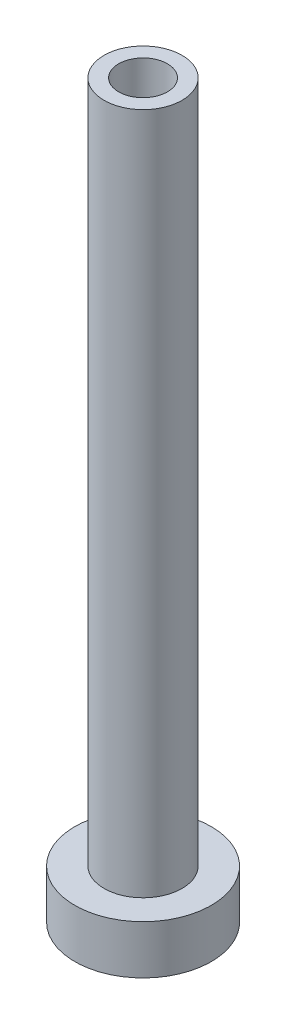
ISO-10303-21;
HEADER;
FILE_DESCRIPTION(('STEP AP214'),'2;1');
FILE_NAME('part.step','',(''),(''),'','','');
FILE_SCHEMA(('AUTOMOTIVE_DESIGN { 1 0 10303 214 1 1 1 1 }'));
ENDSEC;
DATA;
#1=APPLICATION_CONTEXT('core data for automotive mechanical design processes');
#2=APPLICATION_PROTOCOL_DEFINITION('international standard','automotive_design',2000,#1);
#3=PRODUCT_CONTEXT('',#1,'mechanical');
#4=PRODUCT('Part','Part','',(#3));
#5=PRODUCT_RELATED_PRODUCT_CATEGORY('part','',(#4));
#6=PRODUCT_DEFINITION_FORMATION('','',#4);
#7=PRODUCT_DEFINITION_CONTEXT('part definition',#1,'design');
#8=PRODUCT_DEFINITION('design','',#6,#7);
#9=PRODUCT_DEFINITION_SHAPE('','',#8);
#10=(LENGTH_UNIT() NAMED_UNIT(*) SI_UNIT(.MILLI.,.METRE.));
#11=(NAMED_UNIT(*) PLANE_ANGLE_UNIT() SI_UNIT($,.RADIAN.));
#12=(NAMED_UNIT(*) SI_UNIT($,.STERADIAN.) SOLID_ANGLE_UNIT());
#13=UNCERTAINTY_MEASURE_WITH_UNIT(LENGTH_MEASURE(1.E-05),#10,'distance_accuracy_value','');
#14=(GEOMETRIC_REPRESENTATION_CONTEXT(3) GLOBAL_UNCERTAINTY_ASSIGNED_CONTEXT((#13)) GLOBAL_UNIT_ASSIGNED_CONTEXT((#10,
#11,#12)) REPRESENTATION_CONTEXT('',''));
#15=CARTESIAN_POINT('',(0.,0.,0.));
#16=DIRECTION('',(0.,0.,1.));
#17=DIRECTION('',(1.,0.,0.));
#18=AXIS2_PLACEMENT_3D('',#15,#16,#17);
#19=CARTESIAN_POINT('',(0.,0.,0.));
#20=DIRECTION('',(0.,-1.,0.));
#21=DIRECTION('',(0.,0.,-1.));
#22=AXIS2_PLACEMENT_3D('',#19,#20,#21);
#23=CYLINDRICAL_SURFACE('',#22,7.);
#24=CARTESIAN_POINT('',(0.,-5.,0.));
#25=DIRECTION('',(0.,-1.,0.));
#26=DIRECTION('',(0.,0.,-1.));
#27=AXIS2_PLACEMENT_3D('',#24,#25,#26);
#28=CIRCLE('',#27,7.);
#29=CARTESIAN_POINT('',(0.,-5.,-7.));
#30=VERTEX_POINT('',#29);
#31=EDGE_CURVE('E42',#30,#30,#28,.T.);
#32=ORIENTED_EDGE('',*,*,#31,.F.);
#33=EDGE_LOOP('',(#32));
#34=FACE_BOUND('',#33,.T.);
#35=CARTESIAN_POINT('',(0.,0.,0.));
#36=DIRECTION('',(0.,-1.,0.));
#37=DIRECTION('',(0.,0.,-1.));
#38=AXIS2_PLACEMENT_3D('',#35,#36,#37);
#39=CIRCLE('',#38,7.);
#40=CARTESIAN_POINT('',(0.,0.,-7.));
#41=VERTEX_POINT('',#40);
#42=EDGE_CURVE('E9',#41,#41,#39,.T.);
#43=ORIENTED_EDGE('',*,*,#42,.T.);
#44=EDGE_LOOP('',(#43));
#45=FACE_BOUND('',#44,.T.);
#46=ADVANCED_FACE('F14',(#34,#45),#23,.T.);
#47=CARTESIAN_POINT('',(-7.,0.,0.));
#48=DIRECTION('',(0.,-1.,0.));
#49=DIRECTION('',(0.,0.,-1.));
#50=AXIS2_PLACEMENT_3D('',#47,#48,#49);
#51=PLANE('',#50);
#52=ORIENTED_EDGE('',*,*,#42,.F.);
#53=EDGE_LOOP('',(#52));
#54=FACE_BOUND('',#53,.T.);
#55=CARTESIAN_POINT('',(0.,0.,0.));
#56=DIRECTION('',(0.,-1.,0.));
#57=DIRECTION('',(0.,0.,-1.));
#58=AXIS2_PLACEMENT_3D('',#55,#56,#57);
#59=CIRCLE('',#58,4.);
#60=CARTESIAN_POINT('',(0.,0.,-4.));
#61=VERTEX_POINT('',#60);
#62=EDGE_CURVE('E20',#61,#61,#59,.T.);
#63=ORIENTED_EDGE('',*,*,#62,.T.);
#64=EDGE_LOOP('',(#63));
#65=FACE_BOUND('',#64,.T.);
#66=ADVANCED_FACE('F49',(#54,#65),#51,.F.);
#67=CARTESIAN_POINT('',(0.,0.,0.));
#68=DIRECTION('',(0.,-1.,0.));
#69=DIRECTION('',(0.,0.,-1.));
#70=AXIS2_PLACEMENT_3D('',#67,#68,#69);
#71=CYLINDRICAL_SURFACE('',#70,4.);
#72=ORIENTED_EDGE('',*,*,#62,.F.);
#73=EDGE_LOOP('',(#72));
#74=FACE_BOUND('',#73,.T.);
#75=CARTESIAN_POINT('',(0.,70.,0.));
#76=DIRECTION('',(0.,-1.,0.));
#77=DIRECTION('',(0.,0.,-1.));
#78=AXIS2_PLACEMENT_3D('',#75,#76,#77);
#79=CIRCLE('',#78,4.);
#80=CARTESIAN_POINT('',(0.,70.,-4.));
#81=VERTEX_POINT('',#80);
#82=EDGE_CURVE('E24',#81,#81,#79,.T.);
#83=ORIENTED_EDGE('',*,*,#82,.T.);
#84=EDGE_LOOP('',(#83));
#85=FACE_BOUND('',#84,.T.);
#86=ADVANCED_FACE('F55',(#74,#85),#71,.T.);
#87=CARTESIAN_POINT('',(-4.,70.,0.));
#88=DIRECTION('',(0.,-1.,0.));
#89=DIRECTION('',(0.,0.,-1.));
#90=AXIS2_PLACEMENT_3D('',#87,#88,#89);
#91=PLANE('',#90);
#92=ORIENTED_EDGE('',*,*,#82,.F.);
#93=EDGE_LOOP('',(#92));
#94=FACE_BOUND('',#93,.T.);
#95=CARTESIAN_POINT('',(0.,70.,0.));
#96=DIRECTION('',(0.,-1.,0.));
#97=DIRECTION('',(0.,0.,-1.));
#98=AXIS2_PLACEMENT_3D('',#95,#96,#97);
#99=CIRCLE('',#98,2.49999999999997);
#100=CARTESIAN_POINT('',(0.,70.,-2.49999999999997));
#101=VERTEX_POINT('',#100);
#102=EDGE_CURVE('E28',#101,#101,#99,.T.);
#103=ORIENTED_EDGE('',*,*,#102,.T.);
#104=EDGE_LOOP('',(#103));
#105=FACE_BOUND('',#104,.T.);
#106=ADVANCED_FACE('F61',(#94,#105),#91,.F.);
#107=CARTESIAN_POINT('',(0.,0.,0.));
#108=DIRECTION('',(0.,-1.,0.));
#109=DIRECTION('',(0.,0.,-1.));
#110=AXIS2_PLACEMENT_3D('',#107,#108,#109);
#111=CYLINDRICAL_SURFACE('',#110,2.49999999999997);
#112=ORIENTED_EDGE('',*,*,#102,.F.);
#113=EDGE_LOOP('',(#112));
#114=FACE_BOUND('',#113,.T.);
#115=CARTESIAN_POINT('',(0.,25.,0.));
#116=DIRECTION('',(0.,-1.,0.));
#117=DIRECTION('',(0.,0.,-1.));
#118=AXIS2_PLACEMENT_3D('',#115,#116,#117);
#119=CIRCLE('',#118,2.49999999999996);
#120=CARTESIAN_POINT('',(0.,25.,-2.49999999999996));
#121=VERTEX_POINT('',#120);
#122=EDGE_CURVE('E33',#121,#121,#119,.T.);
#123=ORIENTED_EDGE('',*,*,#122,.T.);
#124=EDGE_LOOP('',(#123));
#125=FACE_BOUND('',#124,.T.);
#126=ADVANCED_FACE('F67',(#114,#125),#111,.F.);
#127=CARTESIAN_POINT('',(0.,24.75,0.));
#128=DIRECTION('',(0.,-1.,0.));
#129=DIRECTION('',(0.,0.,-1.));
#130=AXIS2_PLACEMENT_3D('',#127,#128,#129);
#131=CONICAL_SURFACE('',#130,2.75,0.785398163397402);
#132=ORIENTED_EDGE('',*,*,#122,.F.);
#133=EDGE_LOOP('',(#132));
#134=FACE_BOUND('',#133,.T.);
#135=CARTESIAN_POINT('',(0.,24.75,0.));
#136=DIRECTION('',(0.,-1.,0.));
#137=DIRECTION('',(0.,0.,-1.));
#138=AXIS2_PLACEMENT_3D('',#135,#136,#137);
#139=CIRCLE('',#138,2.75);
#140=CARTESIAN_POINT('',(0.,24.75,-2.75));
#141=VERTEX_POINT('',#140);
#142=EDGE_CURVE('E36',#141,#141,#139,.T.);
#143=ORIENTED_EDGE('',*,*,#142,.T.);
#144=EDGE_LOOP('',(#143));
#145=FACE_BOUND('',#144,.T.);
#146=ADVANCED_FACE('F71',(#134,#145),#131,.F.);
#147=CARTESIAN_POINT('',(0.,0.,0.));
#148=DIRECTION('',(0.,-1.,0.));
#149=DIRECTION('',(0.,0.,-1.));
#150=AXIS2_PLACEMENT_3D('',#147,#148,#149);
#151=CYLINDRICAL_SURFACE('',#150,2.75);
#152=ORIENTED_EDGE('',*,*,#142,.F.);
#153=EDGE_LOOP('',(#152));
#154=FACE_BOUND('',#153,.T.);
#155=CARTESIAN_POINT('',(0.,-5.,0.));
#156=DIRECTION('',(0.,-1.,0.));
#157=DIRECTION('',(0.,0.,-1.));
#158=AXIS2_PLACEMENT_3D('',#155,#156,#157);
#159=CIRCLE('',#158,2.75);
#160=CARTESIAN_POINT('',(0.,-5.,-2.75));
#161=VERTEX_POINT('',#160);
#162=EDGE_CURVE('E39',#161,#161,#159,.T.);
#163=ORIENTED_EDGE('',*,*,#162,.T.);
#164=EDGE_LOOP('',(#163));
#165=FACE_BOUND('',#164,.T.);
#166=ADVANCED_FACE('F75',(#154,#165),#151,.F.);
#167=CARTESIAN_POINT('',(-2.75,-5.,0.));
#168=DIRECTION('',(0.,1.,0.));
#169=DIRECTION('',(0.,0.,1.));
#170=AXIS2_PLACEMENT_3D('',#167,#168,#169);
#171=PLANE('',#170);
#172=ORIENTED_EDGE('',*,*,#162,.F.);
#173=EDGE_LOOP('',(#172));
#174=FACE_BOUND('',#173,.T.);
#175=ORIENTED_EDGE('',*,*,#31,.T.);
#176=EDGE_LOOP('',(#175));
#177=FACE_BOUND('',#176,.T.);
#178=ADVANCED_FACE('F46',(#174,#177),#171,.F.);
#179=CLOSED_SHELL('',(#46,#66,#86,#106,#126,#146,#166,#178));
#180=MANIFOLD_SOLID_BREP('B1',#179);
#181=ADVANCED_BREP_SHAPE_REPRESENTATION('',(#18,#180),#14);
#182=SHAPE_DEFINITION_REPRESENTATION(#9,#181);
ENDSEC;
END-ISO-10303-21;
